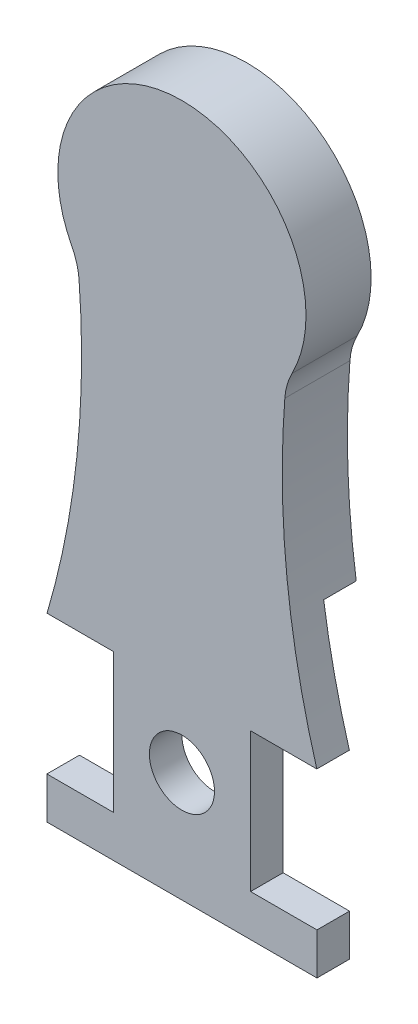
from build123d import *

# Parameters (mm, degrees)
BODY_DEPTH            = 10
SKETCH2_R             = 5
ATTACHMENT_HOLE_DEPTH = 107.750930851
CUT_EXTRUDE28_DEPTH   = 107.750930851
CUT_EXTRUDE30_DEPTH   = 5
FILLET1_R             = 10
FILLET2_R             = 10


with BuildPart() as part:
    # Sketch1 → Body (new body)
    with BuildSketch(Plane.XY):
        with BuildLine():
            ThreePointArc((-57.453333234, -48.209070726), (-24.034507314, 1.033281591), (-16, 60))
            ThreePointArc((-16, 60), (0, 89.414069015), (16, 60))
            ThreePointArc((16, 60), (24.034507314, 1.033281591), (57.453333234, -48.209070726))
            ThreePointArc((57.453333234, -48.209070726), (0, -75), (-57.453333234, -48.209070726))
        make_face()
    extrude(amount=BODY_DEPTH)

    # Sketch2 → Attachment Hole (cut, through all)
    with BuildSketch(Plane.XY.offset(10)):
        Circle(SKETCH2_R)
    extrude(amount=-ATTACHMENT_HOLE_DEPTH, mode=Mode.SUBTRACT)

    # Sketch34 → Cut-Extrude28 (cut, through all)
    with BuildSketch(Plane.XY.offset(10)):
        with BuildLine():
            Line((-20.993197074, 10.845815), (-10.542895, 10.845815))
            Line((-10.542895, 10.845815), (-10.542895, -10.542895))
            Line((-10.542895, -10.542895), (-20.741205, -10.542895))
            Line((-20.741205, -10.542895), (-20.741205, -16.942445))
            Line((-20.741205, -16.942445), (20.741205, -16.942445))
            Line((20.741205, -16.942445), (20.741205, -10.542895))
            Line((20.741205, -10.542895), (10.542895, -10.542895))
            Line((10.542895, -10.542895), (10.542895, 10.845815))
            Line((10.542895, 10.845815), (20.993197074, 10.845815))
            ThreePointArc((20.993197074, 10.845815), (36.689111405, -20.246199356), (57.453333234, -48.209070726))
            ThreePointArc((57.453333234, -48.209070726), (0, -75), (-57.453333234, -48.209070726))
            ThreePointArc((-57.453333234, -48.209070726), (-35.302517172, -21.102274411), (-20.993197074, 10.845815))
        make_face()
    extrude(amount=-CUT_EXTRUDE28_DEPTH, mode=Mode.SUBTRACT)

    # Sketch35 → Cut-Extrude30 (cut)
    with BuildSketch(Plane(origin=(0, 0, 0), x_dir=(-1, 0, 0), z_dir=(0, 0, -1))):
        with BuildLine():
            Line((20.993197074, 10.845815), (10.542895, 10.845815))
            Line((10.542895, 10.845815), (10.542895, -10.542895))
            Line((10.542895, -10.542895), (20.741205, -10.542895))
            Line((20.741205, -10.542895), (20.741205, -16.942445))
            Line((20.741205, -16.942445), (-20.741205, -16.942445))
            Line((-20.741205, -16.942445), (-20.741205, -10.542895))
            Line((-20.741205, -10.542895), (-10.542895, -10.542895))
            Line((-10.542895, -10.542895), (-10.542895, 10.845815))
            Line((-10.542895, 10.845815), (-20.993197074, 10.845815))
            ThreePointArc((-20.993197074, 10.845815), (-18.675130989, 19.753520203), (-16.85963199, 28.777078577))
            ThreePointArc((-16.85963199, 28.777078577), (0, 36.631345), (16.85963199, 28.777078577))
            ThreePointArc((16.85963199, 28.777078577), (18.631142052, 19.74337975), (20.993197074, 10.845815))
        make_face()
    extrude(amount=-CUT_EXTRUDE30_DEPTH, mode=Mode.SUBTRACT)

    # Fillet1
    fillet1_edges = [part.edges().sort_by_distance(p)[0] for p in [
        (16, 60, 5),
    ]]
    fillet(fillet1_edges, radius=FILLET1_R)

    # Fillet2
    fillet2_edges = [part.edges().sort_by_distance(p)[0] for p in [
        (-16, 60, 5),
    ]]
    fillet(fillet2_edges, radius=FILLET2_R)


solid = part.part
